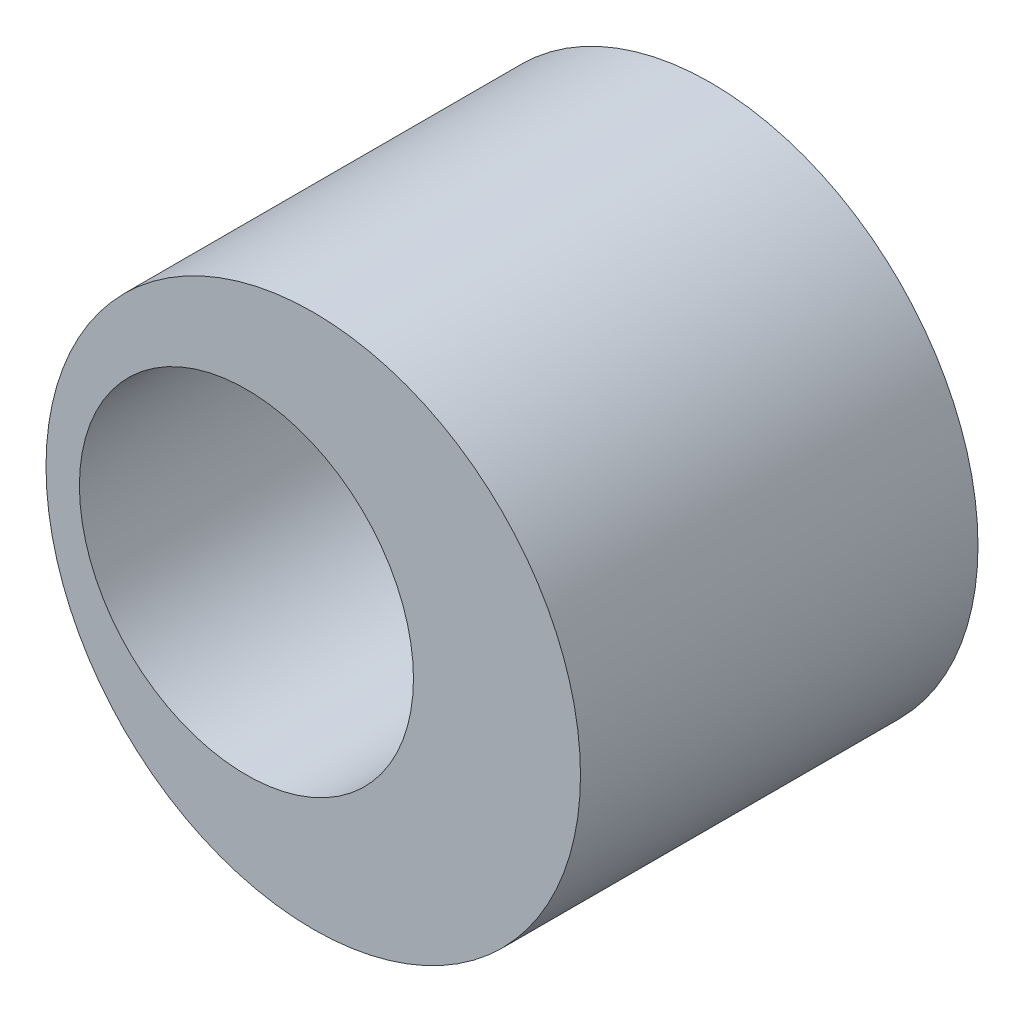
ISO-10303-21;
HEADER;
FILE_DESCRIPTION(('STEP AP214'),'2;1');
FILE_NAME('part.step','',(''),(''),'','','');
FILE_SCHEMA(('AUTOMOTIVE_DESIGN { 1 0 10303 214 1 1 1 1 }'));
ENDSEC;
DATA;
#1=APPLICATION_CONTEXT('core data for automotive mechanical design processes');
#2=APPLICATION_PROTOCOL_DEFINITION('international standard','automotive_design',2000,#1);
#3=PRODUCT_CONTEXT('',#1,'mechanical');
#4=PRODUCT('Part','Part','',(#3));
#5=PRODUCT_RELATED_PRODUCT_CATEGORY('part','',(#4));
#6=PRODUCT_DEFINITION_FORMATION('','',#4);
#7=PRODUCT_DEFINITION_CONTEXT('part definition',#1,'design');
#8=PRODUCT_DEFINITION('design','',#6,#7);
#9=PRODUCT_DEFINITION_SHAPE('','',#8);
#10=(LENGTH_UNIT() NAMED_UNIT(*) SI_UNIT(.MILLI.,.METRE.));
#11=(NAMED_UNIT(*) PLANE_ANGLE_UNIT() SI_UNIT($,.RADIAN.));
#12=(NAMED_UNIT(*) SI_UNIT($,.STERADIAN.) SOLID_ANGLE_UNIT());
#13=UNCERTAINTY_MEASURE_WITH_UNIT(LENGTH_MEASURE(1.E-05),#10,'distance_accuracy_value','');
#14=(GEOMETRIC_REPRESENTATION_CONTEXT(3) GLOBAL_UNCERTAINTY_ASSIGNED_CONTEXT((#13)) GLOBAL_UNIT_ASSIGNED_CONTEXT((#10,
#11,#12)) REPRESENTATION_CONTEXT('',''));
#15=CARTESIAN_POINT('',(0.,0.,0.));
#16=DIRECTION('',(0.,0.,1.));
#17=DIRECTION('',(1.,0.,0.));
#18=AXIS2_PLACEMENT_3D('',#15,#16,#17);
#19=CARTESIAN_POINT('',(0.,0.,11.9));
#20=DIRECTION('',(0.,0.,1.));
#21=DIRECTION('',(1.,0.,0.));
#22=AXIS2_PLACEMENT_3D('',#19,#20,#21);
#23=PLANE('',#22);
#24=CARTESIAN_POINT('',(0.,0.,11.9));
#25=DIRECTION('',(0.,0.,1.));
#26=DIRECTION('',(1.,0.,0.));
#27=AXIS2_PLACEMENT_3D('',#24,#25,#26);
#28=CIRCLE('',#27,8.);
#29=CARTESIAN_POINT('',(8.,0.,11.9));
#30=VERTEX_POINT('',#29);
#31=EDGE_CURVE('E8',#30,#30,#28,.T.);
#32=ORIENTED_EDGE('',*,*,#31,.T.);
#33=EDGE_LOOP('',(#32));
#34=FACE_BOUND('',#33,.T.);
#35=CARTESIAN_POINT('',(-2.,0.,11.9));
#36=DIRECTION('',(0.,0.,1.));
#37=DIRECTION('',(1.,0.,0.));
#38=AXIS2_PLACEMENT_3D('',#35,#36,#37);
#39=CIRCLE('',#38,5.);
#40=CARTESIAN_POINT('',(3.,0.,11.9));
#41=VERTEX_POINT('',#40);
#42=EDGE_CURVE('E23',#41,#41,#39,.T.);
#43=ORIENTED_EDGE('',*,*,#42,.F.);
#44=EDGE_LOOP('',(#43));
#45=FACE_BOUND('',#44,.T.);
#46=ADVANCED_FACE('F12',(#34,#45),#23,.T.);
#47=CARTESIAN_POINT('',(0.,0.,0.));
#48=DIRECTION('',(0.,0.,1.));
#49=DIRECTION('',(1.,0.,0.));
#50=AXIS2_PLACEMENT_3D('',#47,#48,#49);
#51=PLANE('',#50);
#52=CARTESIAN_POINT('',(0.,0.,0.));
#53=DIRECTION('',(0.,0.,1.));
#54=DIRECTION('',(1.,0.,0.));
#55=AXIS2_PLACEMENT_3D('',#52,#53,#54);
#56=CIRCLE('',#55,8.);
#57=CARTESIAN_POINT('',(8.,0.,0.));
#58=VERTEX_POINT('',#57);
#59=EDGE_CURVE('E19',#58,#58,#56,.T.);
#60=ORIENTED_EDGE('',*,*,#59,.F.);
#61=EDGE_LOOP('',(#60));
#62=FACE_BOUND('',#61,.T.);
#63=CARTESIAN_POINT('',(-2.,0.,0.));
#64=DIRECTION('',(0.,0.,1.));
#65=DIRECTION('',(1.,0.,0.));
#66=AXIS2_PLACEMENT_3D('',#63,#64,#65);
#67=CIRCLE('',#66,5.);
#68=CARTESIAN_POINT('',(3.,0.,0.));
#69=VERTEX_POINT('',#68);
#70=EDGE_CURVE('E27',#69,#69,#67,.T.);
#71=ORIENTED_EDGE('',*,*,#70,.T.);
#72=EDGE_LOOP('',(#71));
#73=FACE_BOUND('',#72,.T.);
#74=ADVANCED_FACE('F33',(#62,#73),#51,.F.);
#75=CARTESIAN_POINT('',(0.,0.,11.9));
#76=DIRECTION('',(0.,0.,-1.));
#77=DIRECTION('',(-1.,0.,0.));
#78=AXIS2_PLACEMENT_3D('',#75,#76,#77);
#79=CYLINDRICAL_SURFACE('',#78,8.);
#80=ORIENTED_EDGE('',*,*,#31,.F.);
#81=EDGE_LOOP('',(#80));
#82=FACE_BOUND('',#81,.T.);
#83=ORIENTED_EDGE('',*,*,#59,.T.);
#84=EDGE_LOOP('',(#83));
#85=FACE_BOUND('',#84,.T.);
#86=ADVANCED_FACE('F14',(#82,#85),#79,.T.);
#87=CARTESIAN_POINT('',(-2.,0.,11.9));
#88=DIRECTION('',(0.,0.,-1.));
#89=DIRECTION('',(-1.,0.,0.));
#90=AXIS2_PLACEMENT_3D('',#87,#88,#89);
#91=CYLINDRICAL_SURFACE('',#90,5.);
#92=ORIENTED_EDGE('',*,*,#42,.T.);
#93=EDGE_LOOP('',(#92));
#94=FACE_BOUND('',#93,.T.);
#95=ORIENTED_EDGE('',*,*,#70,.F.);
#96=EDGE_LOOP('',(#95));
#97=FACE_BOUND('',#96,.T.);
#98=ADVANCED_FACE('F35',(#94,#97),#91,.F.);
#99=CLOSED_SHELL('',(#46,#74,#86,#98));
#100=MANIFOLD_SOLID_BREP('B1',#99);
#101=ADVANCED_BREP_SHAPE_REPRESENTATION('',(#18,#100),#14);
#102=SHAPE_DEFINITION_REPRESENTATION(#9,#101);
ENDSEC;
END-ISO-10303-21;
